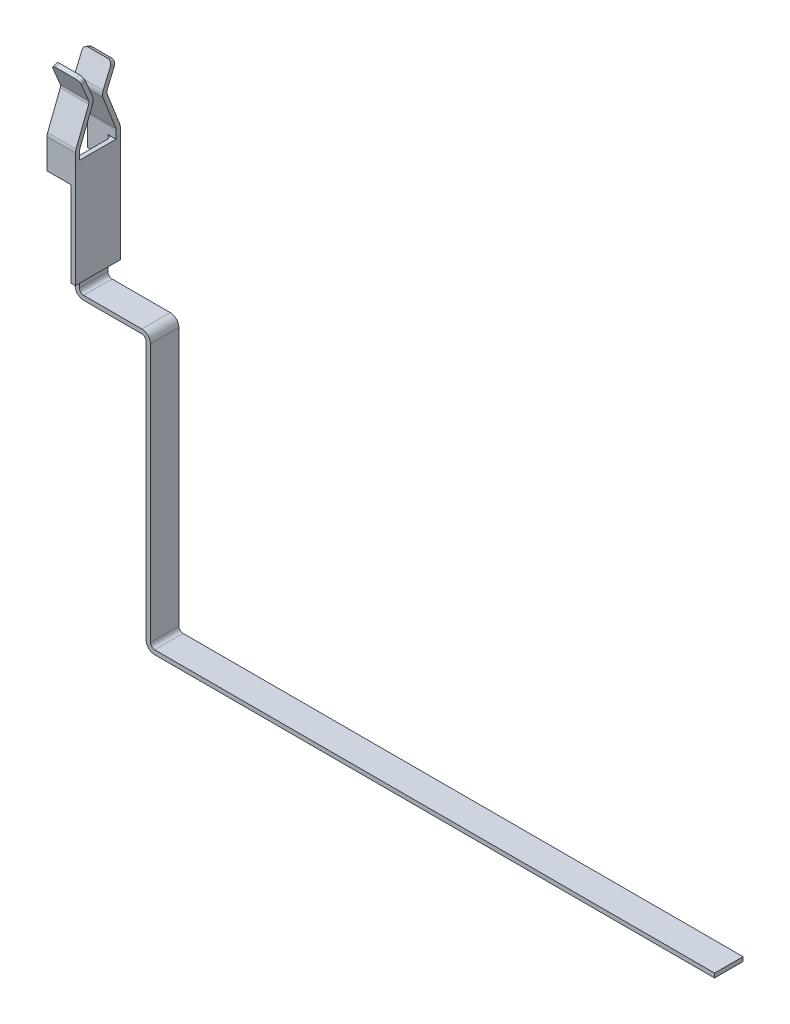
from build123d import *

# Parameters (mm, degrees)
EXTRUDE_THIN1_DEPTH = 1.27
FILLET1_R           = 0.381
FILLET2_R           = 0.762
SKETCH3_W           = 0.381
SKETCH3_H           = 9.525
EXTRUDE_THIN2_DEPTH = 2.0066
EXTRUDE_THIN3_DEPTH = 2.54
FILLET3_R           = 0.381
FILLET4_R           = 0.381
FILLET5_R           = 0.762
FILLET6_R           = 0.381
SKETCH5_W           = 0.381
SKETCH5_H           = 77.343
CUT_EXTRUDE1_DEPTH  = 109.209264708
SKETCH6_W           = 50.8
SKETCH6_H           = 0.381
EXTRUDE_THIN4_DEPTH = 2.54
FILLET7_R           = 0.381
FILLET8_R           = 0.762


with BuildPart() as part:
    # Sketch1 → Extrude-Thin1 (new, symmetric)
    with BuildSketch(Plane.XY):
        Polygon((0, 0), (0, -6.35), (6.35, -6.35), (6.35, -107.95), (6.731, -107.95), (6.731, -5.969), (0.381, -5.969), (0.381, 0), align=None)
    extrude(amount=EXTRUDE_THIN1_DEPTH, both=True)

    # Fillet1
    fillet1_edges = [part.edges().sort_by_distance(p)[0] for p in [
        (6.35, -6.35, 0),
        (0.381, -5.969, 0),
    ]]
    fillet(fillet1_edges, radius=FILLET1_R)

    # Fillet2
    fillet2_edges = [part.edges().sort_by_distance(p)[0] for p in [
        (0, -6.35, 0),
        (6.731, -5.969, 0),
    ]]
    fillet(fillet2_edges, radius=FILLET2_R)

    # Sketch3 → Extrude-Thin2 (add, symmetric)
    with BuildSketch(Plane.XY):
        with Locations((0.5715, -0.088203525)):
            Rectangle(SKETCH3_W, SKETCH3_H)
    extrude(amount=EXTRUDE_THIN2_DEPTH, both=True)

    # Sketch4 → Extrude-Thin3 (add)
    with BuildSketch(Plane(origin=(0.762, 0, 0), x_dir=(0, 0, -1), z_dir=(1, 0, 0))):
        Polygon((-2.0066, 2.769296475), (-2.0066, 5.563296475), (-0.764714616, 8.738296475), (-1.618961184, 10.770296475), (-1.267735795, 10.917950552), (-0.353586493, 8.743459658), (-1.6256, 5.4914342), (-1.6256, 2.769296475), align=None)
    extrude_thin3 = extrude(amount=-EXTRUDE_THIN3_DEPTH)

    # Mirror1: Extrude-Thin3 across plane
    add(extrude_thin3.mirror(Plane.XY))

    # Fillet3
    fillet3_edges = [part.edges().sort_by_distance(p)[0] for p in [
        (0.381, 3.721796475, 1.6256),
        (0.381, 3.721796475, -1.6256),
    ]]
    fillet(fillet3_edges, radius=FILLET3_R)

    # Fillet4
    fillet4_edges = [part.edges().sort_by_distance(p)[0] for p in [
        (-0.508, 5.4914342, 1.6256),
        (-0.508, 8.738296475, 0.764714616),
        (-0.508, 8.738296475, -0.764714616),
        (-0.508, 5.4914342, -1.6256),
    ]]
    fillet(fillet4_edges, radius=FILLET4_R)

    # Fillet5
    fillet5_edges = [part.edges().sort_by_distance(p)[0] for p in [
        (-0.508, 8.743459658, 0.353586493),
        (-0.508, 5.563296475, 2.0066),
        (-0.508, 5.563296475, -2.0066),
        (-0.508, 8.743459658, -0.353586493),
    ]]
    fillet(fillet5_edges, radius=FILLET5_R)

    # Fillet6
    fillet6_edges = [part.edges().sort_by_distance(p)[0] for p in [
        (0.762, 10.844123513, 1.443348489),
        (-1.778, 10.844123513, 1.443348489),
        (-1.778, 10.844123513, -1.443348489),
        (0.762, 10.844123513, -1.443348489),
    ]]
    fillet(fillet6_edges, radius=FILLET6_R)

    # Sketch5 → Cut-Extrude1 (cut, through all)
    with BuildSketch(Plane.XY.offset(1.27)):
        with Locations((6.5405, -69.2785)):
            Rectangle(SKETCH5_W, SKETCH5_H)
    extrude(amount=-CUT_EXTRUDE1_DEPTH, mode=Mode.SUBTRACT)

    # Sketch6 → Extrude-Thin4 (add)
    with BuildSketch(Plane.XY.offset(1.27)):
        with Locations((31.75, -30.4165)):
            Rectangle(SKETCH6_W, SKETCH6_H)
    extrude(amount=-EXTRUDE_THIN4_DEPTH)

    # Fillet7
    fillet7_edges = [part.edges().sort_by_distance(p)[0] for p in [
        (6.731, -30.226, 0),
    ]]
    fillet(fillet7_edges, radius=FILLET7_R)

    # Fillet8
    fillet8_edges = [part.edges().sort_by_distance(p)[0] for p in [
        (6.35, -30.607, 0),
    ]]
    fillet(fillet8_edges, radius=FILLET8_R)


solid = part.part
